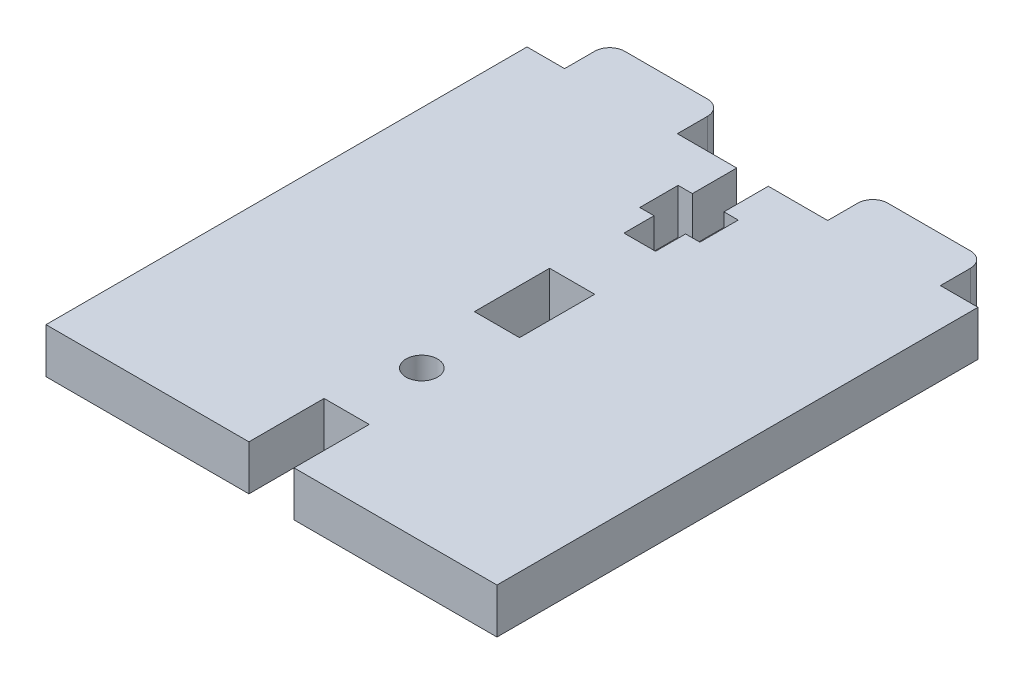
from build123d import *

# Parameters (mm, degrees)
SKETCH_1_R      = 2.1
SKETCH_1_W      = 6
SKETCH_1_H      = 10
EXTRUDE_1_DEPTH = 6


with BuildPart() as part:
    # Sketch 1 → Extrude 1 (new body)
    with BuildSketch(Plane(origin=(0, 0, 0), x_dir=(1, 0, 0), z_dir=(0, 1, 0))):
        with BuildLine():
            Line((5, 0), (0, 0))
            Line((0, 0), (0, -64))
            Line((0, -64), (27, -64))
            Line((27, -64), (27, -54))
            Line((27, -54), (33, -54))
            Line((33, -54), (33, -64))
            Line((33, -64), (60, -64))
            Line((60, -64), (60, 0))
            Line((60, 0), (55, 0))
            Line((55, 0), (55, 4))
            ThreePointArc((55, 4), (54.414213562, 5.414213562), (53, 6))
            Line((53, 6), (42, 6))
            ThreePointArc((42, 6), (40.585786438, 5.414213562), (40, 4))
            Line((40, 4), (40, 0))
            Line((40, 0), (32.1, 0))
            Line((32.1, 0), (32.1, -5.9))
            Line((32.1, -5.9), (34, -5.9))
            Line((34, -5.9), (34, -11))
            Line((34, -11), (32.1, -11))
            Line((32.1, -11), (32.1, -15))
            Line((32.1, -15), (27.9, -15))
            Line((27.9, -15), (27.9, -11))
            Line((27.9, -11), (26, -11))
            Line((26, -11), (26, -5.9))
            Line((26, -5.9), (27.9, -5.9))
            Line((27.9, -5.9), (27.9, 0))
            Line((27.9, 0), (20, 0))
            Line((20, 0), (20, 4))
            ThreePointArc((20, 4), (19.414213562, 5.414213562), (18, 6))
            Line((18, 6), (7, 6))
            ThreePointArc((7, 6), (5.585786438, 5.414213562), (5, 4))
            Line((5, 4), (5, 0))
        make_face()
        with Locations(Location((30, -44, 0), (0, 0, 270))):
            Circle(SKETCH_1_R, mode=Mode.SUBTRACT)
        with Locations((30, -29)):
            Rectangle(SKETCH_1_W, SKETCH_1_H, mode=Mode.SUBTRACT)
    extrude(amount=EXTRUDE_1_DEPTH)


solid = part.part
